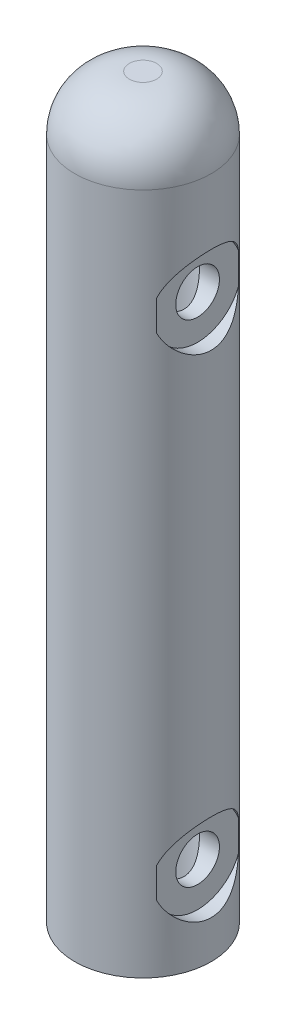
from build123d import *

# Parameters (mm, degrees)
SZKIC1_R                               = 12.5
SZKIC1_R_2                             = 7.5
DODANIE_WYCI_GNI_CIE1_DEPTH            = 120
SZKIC2_R                               = 12.5
DODANIE_WYCI_GNI_CIE2_DEPTH            = 15
ZAOKR_GLENIE2_R                        = 10
WYTNIJ_WYCI_GNI_CIE1_REACH             = 138.152
SZKIC3_R                               = 4
WYTNIJ_WYCI_GNI_CIE1_DIRECTION_2_REACH = 138.152
SZKIC4_R                               = 8
WYTNIJ_WYCI_GNI_CIE2_DEPTH             = 5
SZKIC5_R                               = 10
WYTNIJ_WYCI_GNI_CIE3_DEPTH             = 6


with BuildPart() as part:
    # Szkic1 → Dodanie-wyci_gni_cie1 (new body)
    with BuildSketch(Plane(origin=(0, 0, 0), x_dir=(1, 0, 0), z_dir=(0, 1, 0))):
        with Locations(Location((0, 0, 0), (0, 0, 270))):
            Circle(SZKIC1_R)
        with Locations(Location((0, 0, 0), (0, 0, 270))):
            Circle(SZKIC1_R_2, mode=Mode.SUBTRACT)
    extrude(amount=DODANIE_WYCI_GNI_CIE1_DEPTH)

    # Szkic2 → Dodanie-wyci_gni_cie2 (add)
    with BuildSketch(Plane(origin=(0, 120, 0), x_dir=(1, 0, 0), z_dir=(0, 1, 0))):
        with Locations(Location((0, 0, 0), (0, 0, 270))):
            Circle(SZKIC2_R)
    extrude(amount=DODANIE_WYCI_GNI_CIE2_DEPTH)

    # Zaokr_glenie2
    zaokr_glenie2_edges = [part.edges().sort_by_distance(p)[0] for p in [
        (0, 135, -12.5),
    ]]
    fillet(zaokr_glenie2_edges, radius=ZAOKR_GLENIE2_R)

    # Szkic3 → Wytnij-wyci_gni_cie1 (cut, up to next)
    with BuildSketch(Plane(origin=(0, 0, 0), x_dir=(0, 0, -1), z_dir=(1, 0, 0)), mode=Mode.PRIVATE) as wytnij_wyci_gni_cie1_sk1:
        with Locations(Location((0, 15, 0), (0, 0, 180))):
            Circle(SZKIC3_R)
    wytnij_wyci_gni_cie1_tool1 = extrude(wytnij_wyci_gni_cie1_sk1.sketch, amount=-WYTNIJ_WYCI_GNI_CIE1_REACH, mode=Mode.PRIVATE) & part.part
    # Szkic3 → Wytnij-wyci_gni_cie1 (cut, up to next)
    with BuildSketch(Plane(origin=(0, 0, 0), x_dir=(0, 0, -1), z_dir=(1, 0, 0)), mode=Mode.PRIVATE) as wytnij_wyci_gni_cie1_sk2:
        with Locations((0, 105)):
            Circle(SZKIC3_R)
    wytnij_wyci_gni_cie1_tool2 = extrude(wytnij_wyci_gni_cie1_sk2.sketch, amount=-WYTNIJ_WYCI_GNI_CIE1_REACH, mode=Mode.PRIVATE) & part.part
    add(wytnij_wyci_gni_cie1_tool1.solids().sort_by_distance((0, 15, 0))[0], mode=Mode.SUBTRACT)
    add(wytnij_wyci_gni_cie1_tool2.solids().sort_by_distance((0, 105, 0))[0], mode=Mode.SUBTRACT)

    # Szkic3 → Wytnij-wyci_gni_cie1 direction 2 (cut, up to next)
    with BuildSketch(Plane(origin=(0, 0, 0), x_dir=(0, 0, -1), z_dir=(1, 0, 0)), mode=Mode.PRIVATE) as wytnij_wyci_gni_cie1_direction_2_sk1:
        with Locations(Location((0, 15, 0), (0, 0, 180))):
            Circle(SZKIC3_R)
    wytnij_wyci_gni_cie1_direction_2_tool1 = extrude(wytnij_wyci_gni_cie1_direction_2_sk1.sketch, amount=WYTNIJ_WYCI_GNI_CIE1_DIRECTION_2_REACH, mode=Mode.PRIVATE) & part.part
    # Szkic3 → Wytnij-wyci_gni_cie1 direction 2 (cut, up to next)
    with BuildSketch(Plane(origin=(0, 0, 0), x_dir=(0, 0, -1), z_dir=(1, 0, 0)), mode=Mode.PRIVATE) as wytnij_wyci_gni_cie1_direction_2_sk2:
        with Locations((0, 105)):
            Circle(SZKIC3_R)
    wytnij_wyci_gni_cie1_direction_2_tool2 = extrude(wytnij_wyci_gni_cie1_direction_2_sk2.sketch, amount=WYTNIJ_WYCI_GNI_CIE1_DIRECTION_2_REACH, mode=Mode.PRIVATE) & part.part
    add(wytnij_wyci_gni_cie1_direction_2_tool1.solids().sort_by_distance((0, 15, 0))[0], mode=Mode.SUBTRACT)
    add(wytnij_wyci_gni_cie1_direction_2_tool2.solids().sort_by_distance((0, 105, 0))[0], mode=Mode.SUBTRACT)

    # Szkic4 → Wytnij-wyci_gni_cie2 (cut)
    with BuildSketch(Plane(origin=(15, 0, 0), x_dir=(0, 0, -1), z_dir=(1, 0, 0))):
        with Locations((0, 15)):
            Circle(SZKIC4_R)
        with Locations((0, 105)):
            Circle(SZKIC4_R)
    extrude(amount=-WYTNIJ_WYCI_GNI_CIE2_DEPTH, mode=Mode.SUBTRACT)

    # Szkic5 → Wytnij-wyci_gni_cie3 (cut)
    with BuildSketch(Plane(origin=(-15, 0, 0), x_dir=(0, 0, -1), z_dir=(1, 0, 0))):
        with Locations((0, 15)):
            Circle(SZKIC5_R)
        with Locations((0, 105)):
            Circle(SZKIC5_R)
    extrude(amount=WYTNIJ_WYCI_GNI_CIE3_DEPTH, mode=Mode.SUBTRACT)


solid = part.part
